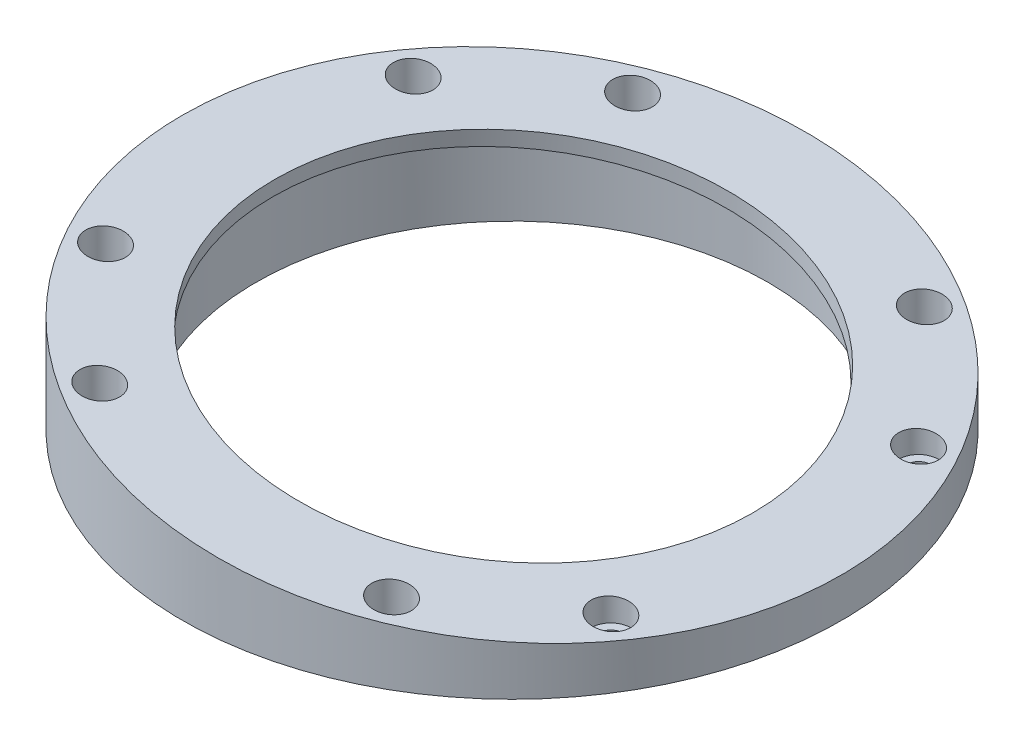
from build123d import *

# Parameters (mm, degrees)
SKETCH1_W                                 = 254
SKETCH1_H                                 = 254
BOSS_EXTRUDE1_DEPTH                       = 254
SKETCH5_W                                 = 254
SKETCH5_H                                 = 254
SKETCH5_R                                 = 66.167
CUT_EXTRUDE2_DEPTH                        = 440.940905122
SKETCH6_R                                 = 42.418
CUT_EXTRUDE3_DEPTH                        = 374.018739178
CUT_EXTRUDE4_REACH                        = 347.459
CUT_EXTRUDE5_START                        = -232.283
SKETCH8_R                                 = 66.167
SKETCH8_R_2                               = 50.8
CUT_EXTRUDE5_DEPTH                        = 232.283
CUT_EXTRUDE6_REACH                        = 375.019
SKETCH11_R                                = 50.8
SKETCH11_R_2                              = 47.625
CUT_EXTRUDE7_REACH                        = 375.019
SKETCH13_R                                = 47.844766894
F_1_16_0_0625_CLEARANCE_DOWEL_HOLE1_D     = 1.5875
F_1_16_0_0625_CLEARANCE_DOWEL_HOLE1_DEPTH = 6.35
F_1_16_0_0625_CLEARANCE_DOWEL_HOLE1_TIP   = 0.476933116
F_1_16_0_0625_PRESS_DOWEL_HOLE1_D         = 1.5875
F_1_16_0_0625_PRESS_DOWEL_HOLE1_DEPTH     = 6.35
F_1_16_0_0625_PRESS_DOWEL_HOLE1_TIP       = 0.476933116
F_4_40_TAPPED_HOLE1_D                     = 2.2606
F_4_40_TAPPED_HOLE1_DEPTH                 = 6.35
F_4_40_TAPPED_HOLE1_CSINK_D               = 4.1148
F_4_40_TAPPED_HOLE1_CSINK_ANGLE           = 100
F_4_40_TAPPED_HOLE1_TIP                   = 0.679152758
F_16_0_177_DIAMETER_HOLE1_D               = 4.4958
SKETCH36_R                                = 3.96875
CUT_EXTRUDE8_DEPTH                        = 17.78
CUT_EXTRUDE9_REACH                        = 276.041
SKETCH37_R                                = 51.435
SKETCH38_R                                = 48.26
CUT_EXTRUDE10_DEPTH                       = 257.077533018


with BuildPart() as part:
    # Sketch1 → Boss-Extrude1 (new body)
    with BuildSketch(Plane.XY):
        with Locations((127, 127)):
            Rectangle(SKETCH1_W, SKETCH1_H)
    extrude(amount=BOSS_EXTRUDE1_DEPTH)

    # Sketch5 → Cut-Extrude2 (cut, through all)
    with BuildSketch(Plane(origin=(0, 254, 0), x_dir=(1, 0, 0), z_dir=(0, 1, 0))):
        with Locations((127, -127)):
            Rectangle(SKETCH5_W, SKETCH5_H)
        with Locations(Location((127, -127, 0), (0, 0, 270))):
            Circle(SKETCH5_R, mode=Mode.SUBTRACT)
    extrude(amount=-CUT_EXTRUDE2_DEPTH, mode=Mode.SUBTRACT)

    # Sketch6 → Cut-Extrude3 (cut, through all)
    with BuildSketch(Plane(origin=(0, 254, 0), x_dir=(1, 0, 0), z_dir=(0, 1, 0))):
        with Locations(Location((127, -127, 0), (0, 0, 270))):
            Circle(SKETCH6_R)
    extrude(amount=-CUT_EXTRUDE3_DEPTH, mode=Mode.SUBTRACT)

    # Sketch7 → Cut-Extrude4 (cut, up to next)
    with BuildSketch(Plane.XY.offset(193.167), mode=Mode.PRIVATE) as cut_extrude4_sk1:
        Polygon((193.167, 254), (193.167, 240.207884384), (60.833, 254), align=None)
    cut_extrude4_tool1 = extrude(cut_extrude4_sk1.sketch, amount=-CUT_EXTRUDE4_REACH, mode=Mode.PRIVATE) & part.part
    add(cut_extrude4_tool1.solids().sort_by_distance((149.055667, 249.402628, 193.167))[0], mode=Mode.SUBTRACT)

    # Sketch8 → Cut-Extrude5 (cut)
    with BuildSketch(Plane.XZ.offset(CUT_EXTRUDE5_START)):
        with Locations(Location((127, 127, 0), (0, 0, 180))):
            Circle(SKETCH8_R)
        with Locations(Location((127, 127, 0), (0, 0, 270))):
            Circle(SKETCH8_R_2, mode=Mode.SUBTRACT)
    extrude(amount=CUT_EXTRUDE5_DEPTH, mode=Mode.SUBTRACT)

    # Cut-Extrude6: up to this plane
    cut_extrude6_end = Plane(origin=(26.512490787, 254.38475528, 60.832), z_dir=(-0.10366053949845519, -0.994612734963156, 0))
    # Sketch11 → Cut-Extrude6 (cut, up to the surface)
    with BuildSketch(Plane.XZ, mode=Mode.PRIVATE) as cut_extrude6_sk1:
        with Locations(Location((127, 127, 0), (0, 0, 270))):
            Circle(SKETCH11_R)
        with Locations(Location((127, 127, 0), (0, 0, 270))):
            Circle(SKETCH11_R_2, mode=Mode.SUBTRACT)
    cut_extrude6_tool1 = split(extrude(cut_extrude6_sk1.sketch, amount=-CUT_EXTRUDE6_REACH, mode=Mode.PRIVATE), bisect_by=cut_extrude6_end, keep=Keep.BOTH, mode=Mode.PRIVATE)
    add(cut_extrude6_tool1.solids().sort_by_distance((127, 0, 176.363159))[0], mode=Mode.SUBTRACT)

    # Cut-Extrude7: up to this face of the body (flat: up to its plane)
    cut_extrude7_end = Plane(part.part.faces().sort_by_distance((126.99999983, 243.911744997, 176.359262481))[0])
    # Sketch13 → Cut-Extrude7 (cut, up to the picked face)
    with BuildSketch(Plane.XZ, mode=Mode.PRIVATE) as cut_extrude7_sk1:
        with Locations((127, 127)):
            Circle(SKETCH13_R)
    cut_extrude7_tool1 = split(extrude(cut_extrude7_sk1.sketch, amount=-CUT_EXTRUDE7_REACH, mode=Mode.PRIVATE), bisect_by=cut_extrude7_end, keep=Keep.BOTH, mode=Mode.PRIVATE)
    add(cut_extrude7_tool1.solids().sort_by(Axis((127, 0, 127), (0, 1, 0)))[0], mode=Mode.SUBTRACT)

    # 1_16 _0.0625_ Clearance Dowel Hole1
    with Locations(Plane(origin=(0, 232.283, 0), x_dir=(-1, 0, 0), z_dir=(0, -1, 0))):
        with Locations((-85.534911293, -166.328983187)):
            Hole(F_1_16_0_0625_CLEARANCE_DOWEL_HOLE1_D / 2, depth=F_1_16_0_0625_CLEARANCE_DOWEL_HOLE1_DEPTH)
            with Locations((0, 0, -(F_1_16_0_0625_CLEARANCE_DOWEL_HOLE1_DEPTH + F_1_16_0_0625_CLEARANCE_DOWEL_HOLE1_TIP / 2))):  # 118° drill point
                Cone(0, F_1_16_0_0625_CLEARANCE_DOWEL_HOLE1_D / 2, F_1_16_0_0625_CLEARANCE_DOWEL_HOLE1_TIP, mode=Mode.SUBTRACT)

    # 1_16 _0.0625_ Press Dowel Hole1
    with Locations(Plane(origin=(0, 232.283, 0), x_dir=(-1, 0, 0), z_dir=(0, -1, 0))):
        with Locations((-168.465088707, -87.671016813)):
            Hole(F_1_16_0_0625_PRESS_DOWEL_HOLE1_D / 2, depth=F_1_16_0_0625_PRESS_DOWEL_HOLE1_DEPTH)
            with Locations((0, 0, -(F_1_16_0_0625_PRESS_DOWEL_HOLE1_DEPTH + F_1_16_0_0625_PRESS_DOWEL_HOLE1_TIP / 2))):  # 118° drill point
                Cone(0, F_1_16_0_0625_PRESS_DOWEL_HOLE1_D / 2, F_1_16_0_0625_PRESS_DOWEL_HOLE1_TIP, mode=Mode.SUBTRACT)

    # 4-40 Tapped Hole1
    with Locations(Plane(origin=(0, 232.283, 0), x_dir=(-1, 0, 0), z_dir=(0, -1, 0))):
        with Locations((-67.203895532, -125.419057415), (-128.580942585, -67.203895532), (-186.796104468, -128.580942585), (-125.419057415, -186.796104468)):
            CounterSinkHole(F_4_40_TAPPED_HOLE1_D / 2, F_4_40_TAPPED_HOLE1_CSINK_D / 2, depth=F_4_40_TAPPED_HOLE1_DEPTH, counter_sink_angle=F_4_40_TAPPED_HOLE1_CSINK_ANGLE)
            with Locations((0, 0, -(F_4_40_TAPPED_HOLE1_DEPTH + F_4_40_TAPPED_HOLE1_TIP / 2))):  # 118° drill point
                Cone(0, F_4_40_TAPPED_HOLE1_D / 2, F_4_40_TAPPED_HOLE1_TIP, mode=Mode.SUBTRACT)

    # 16 _0.177_ Diameter Hole1 (through all)
    with Locations(Plane(origin=(0, 232.283, 0), x_dir=(-1, 0, 0), z_dir=(0, -1, 0))):
        with Locations((-158.466342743, -75.680720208), (-179.910292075, -98.289371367), (-178.319279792, -158.466342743), (-155.710628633, -179.910292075), (-95.533657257, -178.319279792), (-74.089707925, -155.710628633), (-75.680704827, -95.533650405), (-98.289355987, -74.089701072)):
            Hole(F_16_0_177_DIAMETER_HOLE1_D / 2)

    # Sketch36 → Cut-Extrude8 (cut)
    with BuildSketch(Plane(origin=(0, 255.143, 0), x_dir=(-1, 0, 0), z_dir=(0, -1, 0))):
        with Locations((-75.680704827, -95.533650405)):
            Circle(SKETCH36_R)
        with Locations((-98.289355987, -74.089701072)):
            Circle(SKETCH36_R)
        with Locations((-158.466342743, -75.680720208)):
            Circle(SKETCH36_R)
        with Locations((-179.910292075, -98.289371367)):
            Circle(SKETCH36_R)
        with Locations((-178.319279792, -158.466342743)):
            Circle(SKETCH36_R)
        with Locations((-155.710628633, -179.910292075)):
            Circle(SKETCH36_R)
        with Locations((-95.533657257, -178.319279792)):
            Circle(SKETCH36_R)
        with Locations((-74.089707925, -155.710628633)):
            Circle(SKETCH36_R)
    extrude(amount=CUT_EXTRUDE8_DEPTH, mode=Mode.SUBTRACT)

    # Cut-Extrude9: up to this plane
    cut_extrude9_end = Plane(origin=(26.512490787, 254.38475528, 60.832), z_dir=(-0.10366053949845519, -0.994612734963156, 0))
    # Sketch37 → Cut-Extrude9 (cut, up to the surface)
    with BuildSketch(Plane.XZ.offset(-232.283), mode=Mode.PRIVATE) as cut_extrude9_sk1:
        with Locations(Location((127, 127, 0), (0, 0, 270))):
            Circle(SKETCH37_R)
    cut_extrude9_tool1 = split(extrude(cut_extrude9_sk1.sketch, amount=-CUT_EXTRUDE9_REACH, mode=Mode.PRIVATE), bisect_by=cut_extrude9_end, keep=Keep.BOTH, mode=Mode.PRIVATE)
    add(cut_extrude9_tool1.solids().sort_by_distance((127, 232.283, 127))[0], mode=Mode.SUBTRACT)

    # Sketch38 → Cut-Extrude10 (cut, through all)
    with BuildSketch(Plane(origin=(26.512490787, 254.38475528, 0), x_dir=(0.994612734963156, -0.10366053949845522, 0), z_dir=(-0.10366053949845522, -0.994612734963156, 0))):
        with Locations((101.031794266, 127)):
            Circle(SKETCH38_R)
    extrude(amount=-CUT_EXTRUDE10_DEPTH, mode=Mode.SUBTRACT)


solid = part.part
